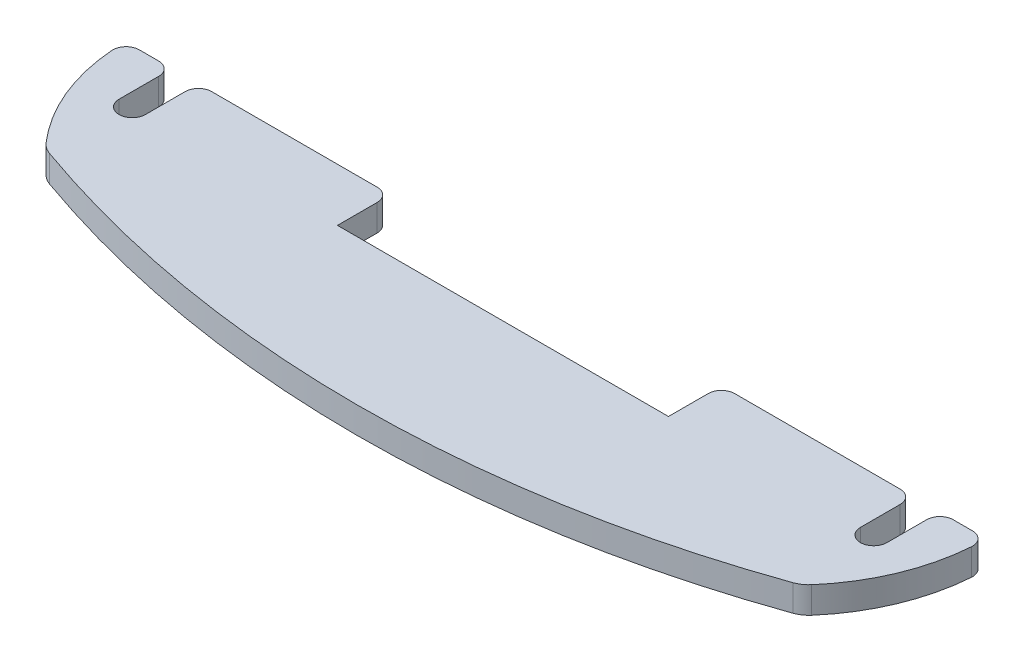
from build123d import *

# Parameters (mm, degrees)
RESSALTO_EXTRUS_O1_DEPTH = 2


with BuildPart() as part:
    # Esbo_o1 → Ressalto-extrus_o1 (new body)
    with BuildSketch(Plane(origin=(0, 0, 0), x_dir=(1, 0, 0), z_dir=(0, 1, 0))):
        with BuildLine():
            Line((-12.5, 0), (12.5, 0))
            Line((12.5, 0), (12.5, 3))
            ThreePointArc((12.5, 3), (12.792893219, 3.707106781), (13.5, 4))
            Line((13.5, 4), (26, 4))
            ThreePointArc((26, 4), (26.707106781, 3.707106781), (27, 3))
            Line((27, 3), (27, 0))
            ThreePointArc((27, 0), (28, -1), (29, 0))
            Line((29, 0), (29, 3))
            ThreePointArc((29, 3), (29.292893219, 3.707106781), (30, 4))
            Line((30, 4), (31.463239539, 4))
            ThreePointArc((31.463239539, 4), (32.195845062, 3.680653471), (32.460540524, 2.926578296))
            ThreePointArc((32.460540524, 2.926578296), (31.37483832, -1.624378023), (28.907100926, -5.599327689))
            ThreePointArc((28.907100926, -5.599327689), (28.523980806, -5.93948611), (28.067011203, -6.171148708))
            ThreePointArc((28.067011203, -6.171148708), (14.239688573, -9.783983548), (0, -11))
            ThreePointArc((0, -11), (-14.239688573, -9.783983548), (-28.067011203, -6.171148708))
            ThreePointArc((-28.067011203, -6.171148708), (-28.523980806, -5.93948611), (-28.907100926, -5.599327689))
            ThreePointArc((-28.907100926, -5.599327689), (-31.37483832, -1.624378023), (-32.460540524, 2.926578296))
            ThreePointArc((-32.460540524, 2.926578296), (-32.195845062, 3.680653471), (-31.463239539, 4))
            Line((-31.463239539, 4), (-30, 4))
            ThreePointArc((-30, 4), (-29.292893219, 3.707106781), (-29, 3))
            Line((-29, 3), (-29, 0))
            ThreePointArc((-29, 0), (-28, -1), (-27, 0))
            Line((-27, 0), (-27, 3))
            ThreePointArc((-27, 3), (-26.707106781, 3.707106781), (-26, 4))
            Line((-26, 4), (-13.5, 4))
            ThreePointArc((-13.5, 4), (-12.792893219, 3.707106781), (-12.5, 3))
            Line((-12.5, 3), (-12.5, 0))
        make_face()
    extrude(amount=RESSALTO_EXTRUS_O1_DEPTH)


solid = part.part
